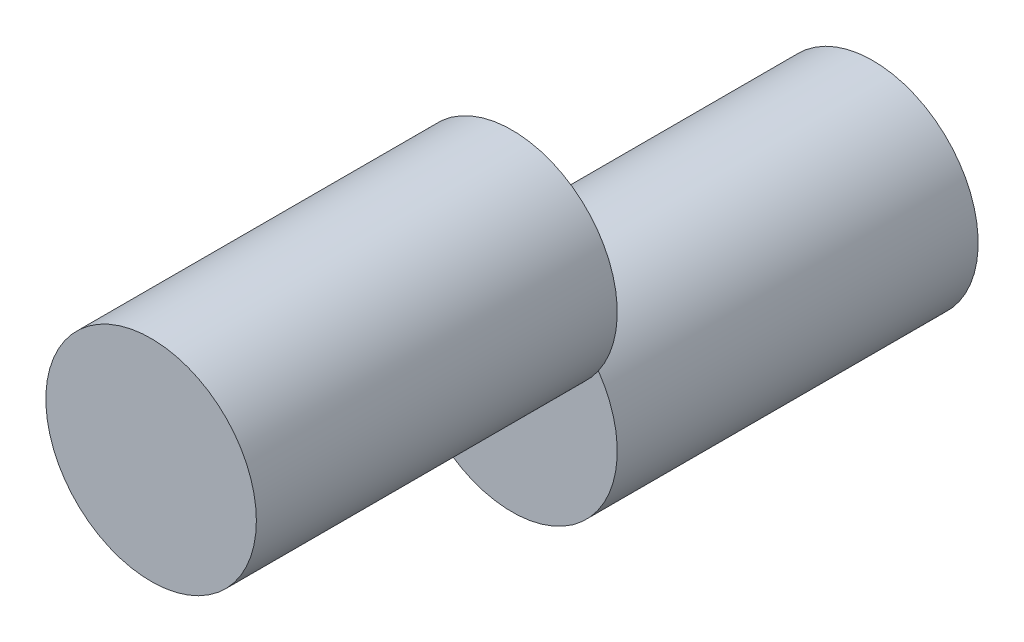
from build123d import *

# Parameters (mm, degrees)
SKETCH2_R           = 44.45
BOSS_EXTRUDE1_DEPTH = 152.4
SKETCH3_R           = 44.45
BOSS_EXTRUDE2_DEPTH = 152.4


with BuildPart() as part:
    # Sketch2 → Boss-Extrude1 (new body)
    with BuildSketch(Plane.XY):
        with Locations(Location((0, 0, 0), (0, 0, 180))):
            Circle(SKETCH2_R)
    extrude(amount=BOSS_EXTRUDE1_DEPTH)

    # Sketch3 → Boss-Extrude2 (add)
    with BuildSketch(Plane(origin=(0, 0, 0), x_dir=(-1, 0, 0), z_dir=(0, 0, -1))):
        with Locations(Location((0, -50.8, 0), (0, 0, 145.150095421))):
            Circle(SKETCH3_R)
    extrude(amount=BOSS_EXTRUDE2_DEPTH)


solid = part.part
